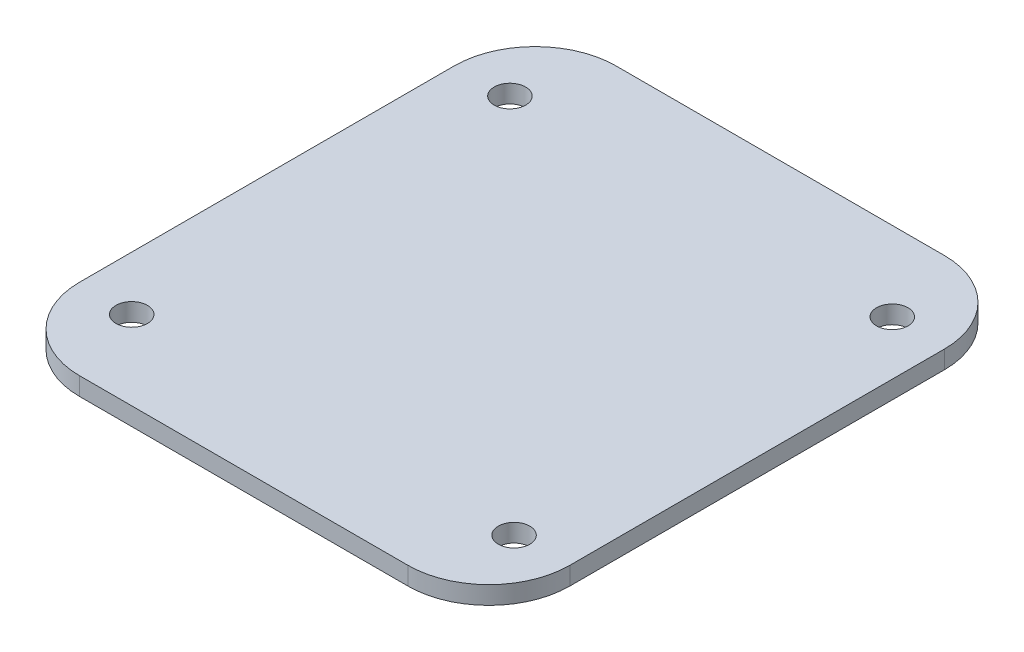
ISO-10303-21;
HEADER;
FILE_DESCRIPTION(('STEP AP214'),'2;1');
FILE_NAME('part.step','',(''),(''),'','','');
FILE_SCHEMA(('AUTOMOTIVE_DESIGN { 1 0 10303 214 1 1 1 1 }'));
ENDSEC;
DATA;
#1=APPLICATION_CONTEXT('core data for automotive mechanical design processes');
#2=APPLICATION_PROTOCOL_DEFINITION('international standard','automotive_design',2000,#1);
#3=PRODUCT_CONTEXT('',#1,'mechanical');
#4=PRODUCT('Part','Part','',(#3));
#5=PRODUCT_RELATED_PRODUCT_CATEGORY('part','',(#4));
#6=PRODUCT_DEFINITION_FORMATION('','',#4);
#7=PRODUCT_DEFINITION_CONTEXT('part definition',#1,'design');
#8=PRODUCT_DEFINITION('design','',#6,#7);
#9=PRODUCT_DEFINITION_SHAPE('','',#8);
#10=(LENGTH_UNIT() NAMED_UNIT(*) SI_UNIT(.MILLI.,.METRE.));
#11=(NAMED_UNIT(*) PLANE_ANGLE_UNIT() SI_UNIT($,.RADIAN.));
#12=(NAMED_UNIT(*) SI_UNIT($,.STERADIAN.) SOLID_ANGLE_UNIT());
#13=UNCERTAINTY_MEASURE_WITH_UNIT(LENGTH_MEASURE(1.E-05),#10,'distance_accuracy_value','');
#14=(GEOMETRIC_REPRESENTATION_CONTEXT(3) GLOBAL_UNCERTAINTY_ASSIGNED_CONTEXT((#13)) GLOBAL_UNIT_ASSIGNED_CONTEXT((#10,
#11,#12)) REPRESENTATION_CONTEXT('',''));
#15=CARTESIAN_POINT('',(0.,0.,0.));
#16=DIRECTION('',(0.,0.,1.));
#17=DIRECTION('',(1.,0.,0.));
#18=AXIS2_PLACEMENT_3D('',#15,#16,#17);
#19=CARTESIAN_POINT('',(0.,0.,0.));
#20=DIRECTION('',(0.,1.,0.));
#21=DIRECTION('',(0.,0.,1.));
#22=AXIS2_PLACEMENT_3D('',#19,#20,#21);
#23=PLANE('',#22);
#24=DIRECTION('',(1.,0.,0.));
#25=VECTOR('',#24,1.);
#26=CARTESIAN_POINT('',(-231.822207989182,0.,378.761207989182));
#27=LINE('',#26,#25);
#28=CARTESIAN_POINT('',(-231.822207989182,0.,378.761207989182));
#29=VERTEX_POINT('',#28);
#30=CARTESIAN_POINT('',(231.822207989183,0.,378.761207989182));
#31=VERTEX_POINT('',#30);
#32=EDGE_CURVE('E138',#29,#31,#27,.T.);
#33=ORIENTED_EDGE('',*,*,#32,.F.);
#34=CARTESIAN_POINT('',(-231.822207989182,0.,264.461207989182));
#35=DIRECTION('',(0.,1.,0.));
#36=DIRECTION('',(0.,0.,-1.));
#37=AXIS2_PLACEMENT_3D('',#34,#35,#36);
#38=CIRCLE('',#37,114.3);
#39=CARTESIAN_POINT('',(-346.122207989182,0.,264.461207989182));
#40=VERTEX_POINT('',#39);
#41=EDGE_CURVE('E97',#40,#29,#38,.T.);
#42=ORIENTED_EDGE('',*,*,#41,.F.);
#43=DIRECTION('',(0.,0.,1.));
#44=VECTOR('',#43,1.);
#45=CARTESIAN_POINT('',(-346.122207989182,0.,-264.461207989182));
#46=LINE('',#45,#44);
#47=CARTESIAN_POINT('',(-346.122207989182,0.,-264.461207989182));
#48=VERTEX_POINT('',#47);
#49=EDGE_CURVE('E115',#48,#40,#46,.T.);
#50=ORIENTED_EDGE('',*,*,#49,.F.);
#51=CARTESIAN_POINT('',(-231.822207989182,0.,-264.461207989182));
#52=DIRECTION('',(0.,1.,0.));
#53=DIRECTION('',(0.,0.,-1.));
#54=AXIS2_PLACEMENT_3D('',#51,#52,#53);
#55=CIRCLE('',#54,114.3);
#56=CARTESIAN_POINT('',(-231.822207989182,0.,-378.761207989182));
#57=VERTEX_POINT('',#56);
#58=EDGE_CURVE('E47',#57,#48,#55,.T.);
#59=ORIENTED_EDGE('',*,*,#58,.F.);
#60=DIRECTION('',(-1.,0.,0.));
#61=VECTOR('',#60,1.);
#62=CARTESIAN_POINT('',(-231.822207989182,0.,-378.761207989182));
#63=LINE('',#62,#61);
#64=CARTESIAN_POINT('',(231.822207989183,0.,-378.761207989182));
#65=VERTEX_POINT('',#64);
#66=EDGE_CURVE('E150',#65,#57,#63,.T.);
#67=ORIENTED_EDGE('',*,*,#66,.F.);
#68=CARTESIAN_POINT('',(231.822207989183,0.,-264.461207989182));
#69=DIRECTION('',(0.,1.,0.));
#70=DIRECTION('',(0.,0.,-1.));
#71=AXIS2_PLACEMENT_3D('',#68,#69,#70);
#72=CIRCLE('',#71,114.3);
#73=CARTESIAN_POINT('',(346.122207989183,0.,-264.461207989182));
#74=VERTEX_POINT('',#73);
#75=EDGE_CURVE('E147',#74,#65,#72,.T.);
#76=ORIENTED_EDGE('',*,*,#75,.F.);
#77=DIRECTION('',(0.,0.,-1.));
#78=VECTOR('',#77,1.);
#79=CARTESIAN_POINT('',(346.122207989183,0.,-264.461207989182));
#80=LINE('',#79,#78);
#81=CARTESIAN_POINT('',(346.122207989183,0.,264.461207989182));
#82=VERTEX_POINT('',#81);
#83=EDGE_CURVE('E144',#82,#74,#80,.T.);
#84=ORIENTED_EDGE('',*,*,#83,.F.);
#85=CARTESIAN_POINT('',(231.822207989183,0.,264.461207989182));
#86=DIRECTION('',(0.,1.,0.));
#87=DIRECTION('',(0.,0.,1.));
#88=AXIS2_PLACEMENT_3D('',#85,#86,#87);
#89=CIRCLE('',#88,114.3);
#90=EDGE_CURVE('E141',#31,#82,#89,.T.);
#91=ORIENTED_EDGE('',*,*,#90,.F.);
#92=EDGE_LOOP('',(#33,#42,#50,#59,#67,#76,#84,#91));
#93=FACE_BOUND('',#92,.T.);
#94=CARTESIAN_POINT('',(-269.922207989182,0.,267.001207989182));
#95=DIRECTION('',(0.,1.,0.));
#96=DIRECTION('',(0.,0.,1.));
#97=AXIS2_PLACEMENT_3D('',#94,#95,#96);
#98=CIRCLE('',#97,22.225);
#99=CARTESIAN_POINT('',(-269.922207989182,0.,289.226207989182));
#100=VERTEX_POINT('',#99);
#101=EDGE_CURVE('E139',#100,#100,#98,.T.);
#102=ORIENTED_EDGE('',*,*,#101,.T.);
#103=EDGE_LOOP('',(#102));
#104=FACE_BOUND('',#103,.T.);
#105=CARTESIAN_POINT('',(-269.922207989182,0.,-267.001207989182));
#106=DIRECTION('',(0.,1.,0.));
#107=DIRECTION('',(0.,0.,1.));
#108=AXIS2_PLACEMENT_3D('',#105,#106,#107);
#109=CIRCLE('',#108,22.225);
#110=CARTESIAN_POINT('',(-269.922207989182,0.,-244.776207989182));
#111=VERTEX_POINT('',#110);
#112=EDGE_CURVE('E296',#111,#111,#109,.T.);
#113=ORIENTED_EDGE('',*,*,#112,.T.);
#114=EDGE_LOOP('',(#113));
#115=FACE_BOUND('',#114,.T.);
#116=CARTESIAN_POINT('',(269.922207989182,0.,-267.001207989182));
#117=DIRECTION('',(0.,1.,0.));
#118=DIRECTION('',(0.,0.,1.));
#119=AXIS2_PLACEMENT_3D('',#116,#117,#118);
#120=CIRCLE('',#119,22.225);
#121=CARTESIAN_POINT('',(269.922207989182,0.,-244.776207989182));
#122=VERTEX_POINT('',#121);
#123=EDGE_CURVE('E290',#122,#122,#120,.T.);
#124=ORIENTED_EDGE('',*,*,#123,.T.);
#125=EDGE_LOOP('',(#124));
#126=FACE_BOUND('',#125,.T.);
#127=CARTESIAN_POINT('',(269.922207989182,0.,267.001207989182));
#128=DIRECTION('',(0.,1.,0.));
#129=DIRECTION('',(0.,0.,1.));
#130=AXIS2_PLACEMENT_3D('',#127,#128,#129);
#131=CIRCLE('',#130,22.225);
#132=CARTESIAN_POINT('',(269.922207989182,0.,289.226207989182));
#133=VERTEX_POINT('',#132);
#134=EDGE_CURVE('E281',#133,#133,#131,.T.);
#135=ORIENTED_EDGE('',*,*,#134,.T.);
#136=EDGE_LOOP('',(#135));
#137=FACE_BOUND('',#136,.T.);
#138=ADVANCED_FACE('F33',(#93,#104,#115,#126,#137),#23,.F.);
#139=CARTESIAN_POINT('',(0.,25.4,0.));
#140=DIRECTION('',(0.,1.,0.));
#141=DIRECTION('',(0.,0.,1.));
#142=AXIS2_PLACEMENT_3D('',#139,#140,#141);
#143=PLANE('',#142);
#144=CARTESIAN_POINT('',(-231.822207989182,25.4,264.461207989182));
#145=DIRECTION('',(0.,1.,0.));
#146=DIRECTION('',(0.,0.,-1.));
#147=AXIS2_PLACEMENT_3D('',#144,#145,#146);
#148=CIRCLE('',#147,114.3);
#149=CARTESIAN_POINT('',(-346.122207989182,25.4,264.461207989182));
#150=VERTEX_POINT('',#149);
#151=CARTESIAN_POINT('',(-231.822207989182,25.4,378.761207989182));
#152=VERTEX_POINT('',#151);
#153=EDGE_CURVE('E55',#150,#152,#148,.T.);
#154=ORIENTED_EDGE('',*,*,#153,.T.);
#155=DIRECTION('',(1.,0.,0.));
#156=VECTOR('',#155,1.);
#157=CARTESIAN_POINT('',(-231.822207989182,25.4,378.761207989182));
#158=LINE('',#157,#156);
#159=CARTESIAN_POINT('',(231.822207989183,25.4,378.761207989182));
#160=VERTEX_POINT('',#159);
#161=EDGE_CURVE('E102',#152,#160,#158,.T.);
#162=ORIENTED_EDGE('',*,*,#161,.T.);
#163=CARTESIAN_POINT('',(231.822207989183,25.4,264.461207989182));
#164=DIRECTION('',(0.,1.,0.));
#165=DIRECTION('',(0.,0.,1.));
#166=AXIS2_PLACEMENT_3D('',#163,#164,#165);
#167=CIRCLE('',#166,114.3);
#168=CARTESIAN_POINT('',(346.122207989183,25.4,264.461207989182));
#169=VERTEX_POINT('',#168);
#170=EDGE_CURVE('E107',#160,#169,#167,.T.);
#171=ORIENTED_EDGE('',*,*,#170,.T.);
#172=DIRECTION('',(0.,0.,-1.));
#173=VECTOR('',#172,1.);
#174=CARTESIAN_POINT('',(346.122207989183,25.4,-264.461207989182));
#175=LINE('',#174,#173);
#176=CARTESIAN_POINT('',(346.122207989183,25.4,-264.461207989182));
#177=VERTEX_POINT('',#176);
#178=EDGE_CURVE('E124',#169,#177,#175,.T.);
#179=ORIENTED_EDGE('',*,*,#178,.T.);
#180=CARTESIAN_POINT('',(231.822207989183,25.4,-264.461207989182));
#181=DIRECTION('',(0.,1.,0.));
#182=DIRECTION('',(0.,0.,-1.));
#183=AXIS2_PLACEMENT_3D('',#180,#181,#182);
#184=CIRCLE('',#183,114.3);
#185=CARTESIAN_POINT('',(231.822207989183,25.4,-378.761207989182));
#186=VERTEX_POINT('',#185);
#187=EDGE_CURVE('E127',#177,#186,#184,.T.);
#188=ORIENTED_EDGE('',*,*,#187,.T.);
#189=DIRECTION('',(-1.,0.,0.));
#190=VECTOR('',#189,1.);
#191=CARTESIAN_POINT('',(-231.822207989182,25.4,-378.761207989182));
#192=LINE('',#191,#190);
#193=CARTESIAN_POINT('',(-231.822207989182,25.4,-378.761207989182));
#194=VERTEX_POINT('',#193);
#195=EDGE_CURVE('E130',#186,#194,#192,.T.);
#196=ORIENTED_EDGE('',*,*,#195,.T.);
#197=CARTESIAN_POINT('',(-231.822207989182,25.4,-264.461207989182));
#198=DIRECTION('',(0.,1.,0.));
#199=DIRECTION('',(0.,0.,-1.));
#200=AXIS2_PLACEMENT_3D('',#197,#198,#199);
#201=CIRCLE('',#200,114.3);
#202=CARTESIAN_POINT('',(-346.122207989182,25.4,-264.461207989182));
#203=VERTEX_POINT('',#202);
#204=EDGE_CURVE('E133',#194,#203,#201,.T.);
#205=ORIENTED_EDGE('',*,*,#204,.T.);
#206=DIRECTION('',(0.,0.,1.));
#207=VECTOR('',#206,1.);
#208=CARTESIAN_POINT('',(-346.122207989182,25.4,-264.461207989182));
#209=LINE('',#208,#207);
#210=EDGE_CURVE('E114',#203,#150,#209,.T.);
#211=ORIENTED_EDGE('',*,*,#210,.T.);
#212=EDGE_LOOP('',(#154,#162,#171,#179,#188,#196,#205,#211));
#213=FACE_BOUND('',#212,.T.);
#214=CARTESIAN_POINT('',(-269.922207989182,25.4,267.001207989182));
#215=DIRECTION('',(0.,1.,0.));
#216=DIRECTION('',(0.,0.,1.));
#217=AXIS2_PLACEMENT_3D('',#214,#215,#216);
#218=CIRCLE('',#217,22.225);
#219=CARTESIAN_POINT('',(-269.922207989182,25.4,289.226207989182));
#220=VERTEX_POINT('',#219);
#221=EDGE_CURVE('E120',#220,#220,#218,.T.);
#222=ORIENTED_EDGE('',*,*,#221,.F.);
#223=EDGE_LOOP('',(#222));
#224=FACE_BOUND('',#223,.T.);
#225=CARTESIAN_POINT('',(-269.922207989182,25.4,-267.001207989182));
#226=DIRECTION('',(0.,1.,0.));
#227=DIRECTION('',(0.,0.,1.));
#228=AXIS2_PLACEMENT_3D('',#225,#226,#227);
#229=CIRCLE('',#228,22.225);
#230=CARTESIAN_POINT('',(-269.922207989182,25.4,-244.776207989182));
#231=VERTEX_POINT('',#230);
#232=EDGE_CURVE('E293',#231,#231,#229,.T.);
#233=ORIENTED_EDGE('',*,*,#232,.F.);
#234=EDGE_LOOP('',(#233));
#235=FACE_BOUND('',#234,.T.);
#236=CARTESIAN_POINT('',(269.922207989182,25.4,-267.001207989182));
#237=DIRECTION('',(0.,1.,0.));
#238=DIRECTION('',(0.,0.,1.));
#239=AXIS2_PLACEMENT_3D('',#236,#237,#238);
#240=CIRCLE('',#239,22.225);
#241=CARTESIAN_POINT('',(269.922207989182,25.4,-244.776207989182));
#242=VERTEX_POINT('',#241);
#243=EDGE_CURVE('E287',#242,#242,#240,.T.);
#244=ORIENTED_EDGE('',*,*,#243,.F.);
#245=EDGE_LOOP('',(#244));
#246=FACE_BOUND('',#245,.T.);
#247=CARTESIAN_POINT('',(269.922207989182,25.4,267.001207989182));
#248=DIRECTION('',(0.,1.,0.));
#249=DIRECTION('',(0.,0.,1.));
#250=AXIS2_PLACEMENT_3D('',#247,#248,#249);
#251=CIRCLE('',#250,22.225);
#252=CARTESIAN_POINT('',(269.922207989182,25.4,289.226207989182));
#253=VERTEX_POINT('',#252);
#254=EDGE_CURVE('E284',#253,#253,#251,.T.);
#255=ORIENTED_EDGE('',*,*,#254,.F.);
#256=EDGE_LOOP('',(#255));
#257=FACE_BOUND('',#256,.T.);
#258=ADVANCED_FACE('F110',(#213,#224,#235,#246,#257),#143,.T.);
#259=CARTESIAN_POINT('',(-231.822207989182,25.4,264.461207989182));
#260=DIRECTION('',(0.,-1.,0.));
#261=DIRECTION('',(0.,0.,-1.));
#262=AXIS2_PLACEMENT_3D('',#259,#260,#261);
#263=CYLINDRICAL_SURFACE('',#262,114.3);
#264=ORIENTED_EDGE('',*,*,#41,.T.);
#265=DIRECTION('',(0.,-1.,0.));
#266=VECTOR('',#265,1.);
#267=CARTESIAN_POINT('',(-231.822207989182,25.4,378.761207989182));
#268=LINE('',#267,#266);
#269=EDGE_CURVE('E11',#152,#29,#268,.T.);
#270=ORIENTED_EDGE('',*,*,#269,.F.);
#271=ORIENTED_EDGE('',*,*,#153,.F.);
#272=DIRECTION('',(0.,-1.,0.));
#273=VECTOR('',#272,1.);
#274=CARTESIAN_POINT('',(-346.122207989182,25.4,264.461207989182));
#275=LINE('',#274,#273);
#276=EDGE_CURVE('E136',#150,#40,#275,.T.);
#277=ORIENTED_EDGE('',*,*,#276,.T.);
#278=EDGE_LOOP('',(#264,#270,#271,#277));
#279=FACE_BOUND('',#278,.T.);
#280=ADVANCED_FACE('F95',(#279),#263,.T.);
#281=CARTESIAN_POINT('',(-231.822207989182,25.4,378.761207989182));
#282=DIRECTION('',(0.,0.,-1.));
#283=DIRECTION('',(-1.,0.,0.));
#284=AXIS2_PLACEMENT_3D('',#281,#282,#283);
#285=PLANE('',#284);
#286=ORIENTED_EDGE('',*,*,#32,.T.);
#287=DIRECTION('',(0.,-1.,0.));
#288=VECTOR('',#287,1.);
#289=CARTESIAN_POINT('',(231.822207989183,25.4,378.761207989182));
#290=LINE('',#289,#288);
#291=EDGE_CURVE('E40',#160,#31,#290,.T.);
#292=ORIENTED_EDGE('',*,*,#291,.F.);
#293=ORIENTED_EDGE('',*,*,#161,.F.);
#294=ORIENTED_EDGE('',*,*,#269,.T.);
#295=EDGE_LOOP('',(#286,#292,#293,#294));
#296=FACE_BOUND('',#295,.T.);
#297=ADVANCED_FACE('F103',(#296),#285,.F.);
#298=CARTESIAN_POINT('',(231.822207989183,25.4,264.461207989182));
#299=DIRECTION('',(0.,-1.,0.));
#300=DIRECTION('',(0.,0.,-1.));
#301=AXIS2_PLACEMENT_3D('',#298,#299,#300);
#302=CYLINDRICAL_SURFACE('',#301,114.3);
#303=ORIENTED_EDGE('',*,*,#90,.T.);
#304=DIRECTION('',(0.,-1.,0.));
#305=VECTOR('',#304,1.);
#306=CARTESIAN_POINT('',(346.122207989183,25.4,264.461207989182));
#307=LINE('',#306,#305);
#308=EDGE_CURVE('E163',#169,#82,#307,.T.);
#309=ORIENTED_EDGE('',*,*,#308,.F.);
#310=ORIENTED_EDGE('',*,*,#170,.F.);
#311=ORIENTED_EDGE('',*,*,#291,.T.);
#312=EDGE_LOOP('',(#303,#309,#310,#311));
#313=FACE_BOUND('',#312,.T.);
#314=ADVANCED_FACE('F165',(#313),#302,.T.);
#315=CARTESIAN_POINT('',(346.122207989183,25.4,-264.461207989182));
#316=DIRECTION('',(-1.,0.,0.));
#317=DIRECTION('',(0.,0.,1.));
#318=AXIS2_PLACEMENT_3D('',#315,#316,#317);
#319=PLANE('',#318);
#320=ORIENTED_EDGE('',*,*,#83,.T.);
#321=DIRECTION('',(0.,-1.,0.));
#322=VECTOR('',#321,1.);
#323=CARTESIAN_POINT('',(346.122207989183,25.4,-264.461207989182));
#324=LINE('',#323,#322);
#325=EDGE_CURVE('E161',#177,#74,#324,.T.);
#326=ORIENTED_EDGE('',*,*,#325,.F.);
#327=ORIENTED_EDGE('',*,*,#178,.F.);
#328=ORIENTED_EDGE('',*,*,#308,.T.);
#329=EDGE_LOOP('',(#320,#326,#327,#328));
#330=FACE_BOUND('',#329,.T.);
#331=ADVANCED_FACE('F173',(#330),#319,.F.);
#332=CARTESIAN_POINT('',(231.822207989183,25.4,-264.461207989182));
#333=DIRECTION('',(0.,-1.,0.));
#334=DIRECTION('',(0.,0.,-1.));
#335=AXIS2_PLACEMENT_3D('',#332,#333,#334);
#336=CYLINDRICAL_SURFACE('',#335,114.3);
#337=ORIENTED_EDGE('',*,*,#75,.T.);
#338=DIRECTION('',(0.,-1.,0.));
#339=VECTOR('',#338,1.);
#340=CARTESIAN_POINT('',(231.822207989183,25.4,-378.761207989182));
#341=LINE('',#340,#339);
#342=EDGE_CURVE('E159',#186,#65,#341,.T.);
#343=ORIENTED_EDGE('',*,*,#342,.F.);
#344=ORIENTED_EDGE('',*,*,#187,.F.);
#345=ORIENTED_EDGE('',*,*,#325,.T.);
#346=EDGE_LOOP('',(#337,#343,#344,#345));
#347=FACE_BOUND('',#346,.T.);
#348=ADVANCED_FACE('F178',(#347),#336,.T.);
#349=CARTESIAN_POINT('',(-231.822207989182,25.4,-378.761207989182));
#350=DIRECTION('',(0.,0.,1.));
#351=DIRECTION('',(1.,0.,0.));
#352=AXIS2_PLACEMENT_3D('',#349,#350,#351);
#353=PLANE('',#352);
#354=ORIENTED_EDGE('',*,*,#66,.T.);
#355=DIRECTION('',(0.,-1.,0.));
#356=VECTOR('',#355,1.);
#357=CARTESIAN_POINT('',(-231.822207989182,25.4,-378.761207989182));
#358=LINE('',#357,#356);
#359=EDGE_CURVE('E157',#194,#57,#358,.T.);
#360=ORIENTED_EDGE('',*,*,#359,.F.);
#361=ORIENTED_EDGE('',*,*,#195,.F.);
#362=ORIENTED_EDGE('',*,*,#342,.T.);
#363=EDGE_LOOP('',(#354,#360,#361,#362));
#364=FACE_BOUND('',#363,.T.);
#365=ADVANCED_FACE('F180',(#364),#353,.F.);
#366=CARTESIAN_POINT('',(-231.822207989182,25.4,-264.461207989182));
#367=DIRECTION('',(0.,-1.,0.));
#368=DIRECTION('',(0.,0.,-1.));
#369=AXIS2_PLACEMENT_3D('',#366,#367,#368);
#370=CYLINDRICAL_SURFACE('',#369,114.3);
#371=ORIENTED_EDGE('',*,*,#58,.T.);
#372=DIRECTION('',(0.,-1.,0.));
#373=VECTOR('',#372,1.);
#374=CARTESIAN_POINT('',(-346.122207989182,25.4,-264.461207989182));
#375=LINE('',#374,#373);
#376=EDGE_CURVE('E155',#203,#48,#375,.T.);
#377=ORIENTED_EDGE('',*,*,#376,.F.);
#378=ORIENTED_EDGE('',*,*,#204,.F.);
#379=ORIENTED_EDGE('',*,*,#359,.T.);
#380=EDGE_LOOP('',(#371,#377,#378,#379));
#381=FACE_BOUND('',#380,.T.);
#382=ADVANCED_FACE('F182',(#381),#370,.T.);
#383=CARTESIAN_POINT('',(-346.122207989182,25.4,-264.461207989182));
#384=DIRECTION('',(1.,0.,0.));
#385=DIRECTION('',(0.,0.,-1.));
#386=AXIS2_PLACEMENT_3D('',#383,#384,#385);
#387=PLANE('',#386);
#388=ORIENTED_EDGE('',*,*,#49,.T.);
#389=ORIENTED_EDGE('',*,*,#276,.F.);
#390=ORIENTED_EDGE('',*,*,#210,.F.);
#391=ORIENTED_EDGE('',*,*,#376,.T.);
#392=EDGE_LOOP('',(#388,#389,#390,#391));
#393=FACE_BOUND('',#392,.T.);
#394=ADVANCED_FACE('F185',(#393),#387,.F.);
#395=CARTESIAN_POINT('',(-269.922207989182,115.202561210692,267.001207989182));
#396=DIRECTION('',(0.,-1.,0.));
#397=DIRECTION('',(0.,0.,-1.));
#398=AXIS2_PLACEMENT_3D('',#395,#396,#397);
#399=CYLINDRICAL_SURFACE('',#398,22.225);
#400=ORIENTED_EDGE('',*,*,#101,.F.);
#401=EDGE_LOOP('',(#400));
#402=FACE_BOUND('',#401,.T.);
#403=ORIENTED_EDGE('',*,*,#221,.T.);
#404=EDGE_LOOP('',(#403));
#405=FACE_BOUND('',#404,.T.);
#406=ADVANCED_FACE('F187',(#402,#405),#399,.F.);
#407=CARTESIAN_POINT('',(-269.922207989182,115.202561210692,-267.001207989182));
#408=DIRECTION('',(0.,-1.,0.));
#409=DIRECTION('',(0.,0.,-1.));
#410=AXIS2_PLACEMENT_3D('',#407,#408,#409);
#411=CYLINDRICAL_SURFACE('',#410,22.225);
#412=ORIENTED_EDGE('',*,*,#112,.F.);
#413=EDGE_LOOP('',(#412));
#414=FACE_BOUND('',#413,.T.);
#415=ORIENTED_EDGE('',*,*,#232,.T.);
#416=EDGE_LOOP('',(#415));
#417=FACE_BOUND('',#416,.T.);
#418=ADVANCED_FACE('F193',(#414,#417),#411,.F.);
#419=CARTESIAN_POINT('',(269.922207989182,115.202561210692,-267.001207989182));
#420=DIRECTION('',(0.,-1.,0.));
#421=DIRECTION('',(0.,0.,-1.));
#422=AXIS2_PLACEMENT_3D('',#419,#420,#421);
#423=CYLINDRICAL_SURFACE('',#422,22.225);
#424=ORIENTED_EDGE('',*,*,#123,.F.);
#425=EDGE_LOOP('',(#424));
#426=FACE_BOUND('',#425,.T.);
#427=ORIENTED_EDGE('',*,*,#243,.T.);
#428=EDGE_LOOP('',(#427));
#429=FACE_BOUND('',#428,.T.);
#430=ADVANCED_FACE('F254',(#426,#429),#423,.F.);
#431=CARTESIAN_POINT('',(269.922207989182,115.202561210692,267.001207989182));
#432=DIRECTION('',(0.,-1.,0.));
#433=DIRECTION('',(0.,0.,-1.));
#434=AXIS2_PLACEMENT_3D('',#431,#432,#433);
#435=CYLINDRICAL_SURFACE('',#434,22.225);
#436=ORIENTED_EDGE('',*,*,#134,.F.);
#437=EDGE_LOOP('',(#436));
#438=FACE_BOUND('',#437,.T.);
#439=ORIENTED_EDGE('',*,*,#254,.T.);
#440=EDGE_LOOP('',(#439));
#441=FACE_BOUND('',#440,.T.);
#442=ADVANCED_FACE('F264',(#438,#441),#435,.F.);
#443=CLOSED_SHELL('',(#138,#258,#280,#297,#314,#331,#348,#365,#382,#394,#406,#418,#430,#442));
#444=MANIFOLD_SOLID_BREP('B2',#443);
#445=ADVANCED_BREP_SHAPE_REPRESENTATION('',(#18,#444),#14);
#446=SHAPE_DEFINITION_REPRESENTATION(#9,#445);
ENDSEC;
END-ISO-10303-21;
